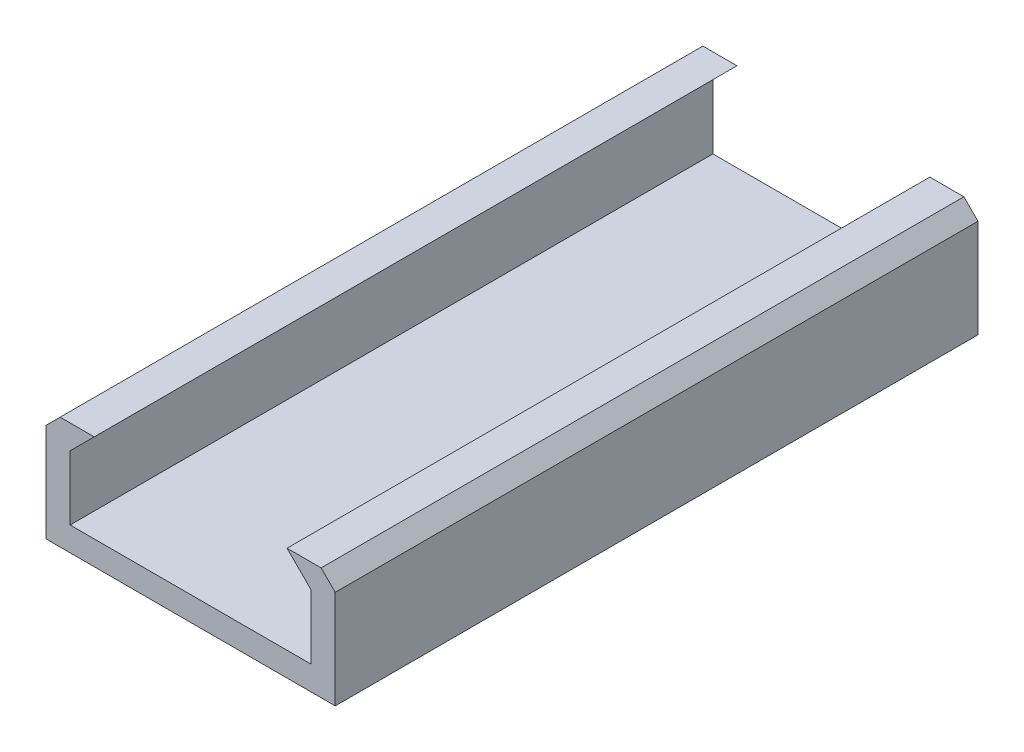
from build123d import *

# Parameters (mm, degrees)
BASE_EXTRUDE_DEPTH = 254


with BuildPart() as part:
    # Sketch1 → Base-Extrude (new body)
    with BuildSketch(Plane.XY):
        Polygon((-47.625, 25.4), (-38.1, 34.925), (-51.570384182, 34.925), (-57.15, 29.345384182), (-57.15, -9.525), (57.15, -9.525), (57.15, 29.345384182), (51.570384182, 34.925), (38.1, 34.925), (47.625, 25.4), (47.625, 0), (-47.625, 0), align=None)
    extrude(amount=-BASE_EXTRUDE_DEPTH)


solid = part.part
